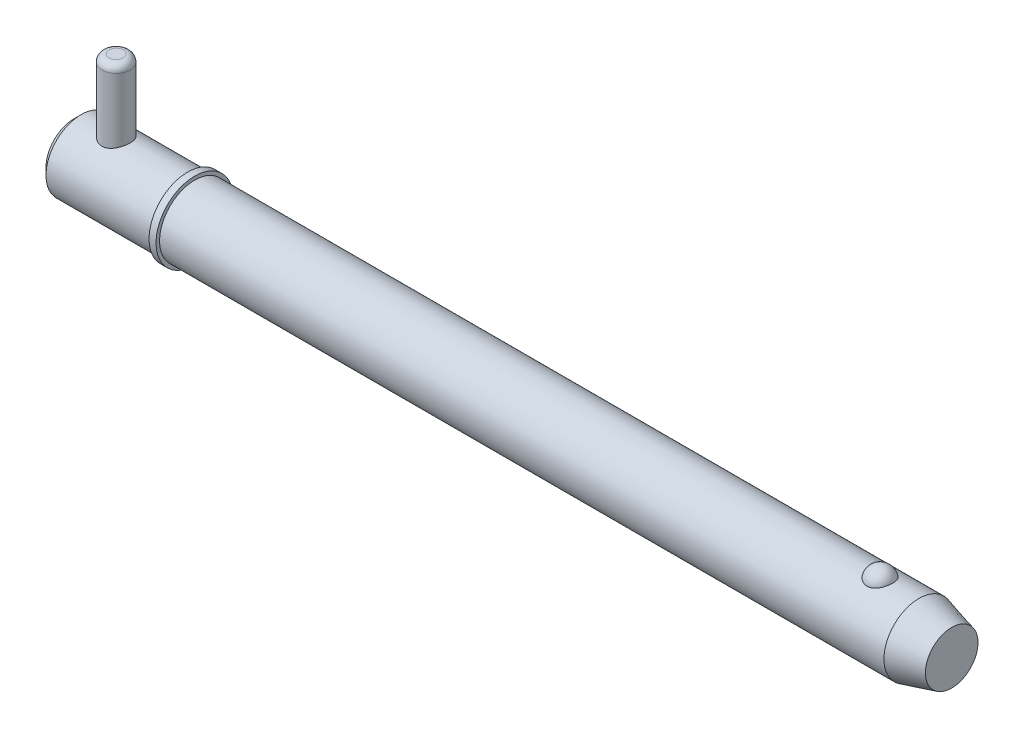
ISO-10303-21;
HEADER;
FILE_DESCRIPTION(('STEP AP214'),'2;1');
FILE_NAME('part.step','',(''),(''),'','','');
FILE_SCHEMA(('AUTOMOTIVE_DESIGN { 1 0 10303 214 1 1 1 1 }'));
ENDSEC;
DATA;
#1=APPLICATION_CONTEXT('core data for automotive mechanical design processes');
#2=APPLICATION_PROTOCOL_DEFINITION('international standard','automotive_design',2000,#1);
#3=PRODUCT_CONTEXT('',#1,'mechanical');
#4=PRODUCT('Part','Part','',(#3));
#5=PRODUCT_RELATED_PRODUCT_CATEGORY('part','',(#4));
#6=PRODUCT_DEFINITION_FORMATION('','',#4);
#7=PRODUCT_DEFINITION_CONTEXT('part definition',#1,'design');
#8=PRODUCT_DEFINITION('design','',#6,#7);
#9=PRODUCT_DEFINITION_SHAPE('','',#8);
#10=(LENGTH_UNIT() NAMED_UNIT(*) SI_UNIT(.MILLI.,.METRE.));
#11=(NAMED_UNIT(*) PLANE_ANGLE_UNIT() SI_UNIT($,.RADIAN.));
#12=(NAMED_UNIT(*) SI_UNIT($,.STERADIAN.) SOLID_ANGLE_UNIT());
#13=UNCERTAINTY_MEASURE_WITH_UNIT(LENGTH_MEASURE(1.E-05),#10,'distance_accuracy_value','');
#14=(GEOMETRIC_REPRESENTATION_CONTEXT(3) GLOBAL_UNCERTAINTY_ASSIGNED_CONTEXT((#13)) GLOBAL_UNIT_ASSIGNED_CONTEXT((#10,
#11,#12)) REPRESENTATION_CONTEXT('',''));
#15=CARTESIAN_POINT('',(0.,0.,0.));
#16=DIRECTION('',(0.,0.,1.));
#17=DIRECTION('',(1.,0.,0.));
#18=AXIS2_PLACEMENT_3D('',#15,#16,#17);
#19=CARTESIAN_POINT('',(9.525,23.81,0.));
#20=DIRECTION('',(0.,-1.,0.));
#21=DIRECTION('',(0.,0.,-1.));
#22=AXIS2_PLACEMENT_3D('',#19,#20,#21);
#23=CYLINDRICAL_SURFACE('',#22,3.175);
#24=CARTESIAN_POINT('',(9.525,-6.3525,0.));
#25=DIRECTION('',(0.,1.,0.));
#26=DIRECTION('',(0.,0.,1.));
#27=AXIS2_PLACEMENT_3D('',#24,#25,#26);
#28=CIRCLE('',#27,3.175);
#29=CARTESIAN_POINT('',(9.525,-6.3525,3.175));
#30=VERTEX_POINT('',#29);
#31=EDGE_CURVE('P0_E25',#30,#30,#28,.T.);
#32=ORIENTED_EDGE('',*,*,#31,.T.);
#33=EDGE_LOOP('',(#32));
#34=FACE_BOUND('',#33,.T.);
#35=CARTESIAN_POINT('',(9.525,22.2225,0.));
#36=DIRECTION('',(0.,1.,0.));
#37=DIRECTION('',(0.,0.,1.));
#38=AXIS2_PLACEMENT_3D('',#35,#36,#37);
#39=CIRCLE('',#38,3.175);
#40=CARTESIAN_POINT('',(9.525,22.2225,3.175));
#41=VERTEX_POINT('',#40);
#42=EDGE_CURVE('P0_E29',#41,#41,#39,.F.);
#43=ORIENTED_EDGE('',*,*,#42,.T.);
#44=EDGE_LOOP('',(#43));
#45=FACE_BOUND('',#44,.T.);
#46=ADVANCED_FACE('P0_F14',(#34,#45),#23,.T.);
#47=CARTESIAN_POINT('',(9.525,23.81,0.));
#48=DIRECTION('',(0.,1.,0.));
#49=DIRECTION('',(0.,0.,1.));
#50=AXIS2_PLACEMENT_3D('',#47,#48,#49);
#51=PLANE('',#50);
#52=CARTESIAN_POINT('',(9.525,23.81,0.));
#53=DIRECTION('',(0.,1.,0.));
#54=DIRECTION('',(0.,0.,1.));
#55=AXIS2_PLACEMENT_3D('',#52,#53,#54);
#56=CIRCLE('',#55,1.5875);
#57=CARTESIAN_POINT('',(9.525,23.81,1.5875));
#58=VERTEX_POINT('',#57);
#59=EDGE_CURVE('P0_E10',#58,#58,#56,.T.);
#60=ORIENTED_EDGE('',*,*,#59,.T.);
#61=EDGE_LOOP('',(#60));
#62=FACE_BOUND('',#61,.T.);
#63=ADVANCED_FACE('P0_F46',(#62),#51,.T.);
#64=CARTESIAN_POINT('',(9.525,-7.94,0.));
#65=DIRECTION('',(0.,1.,0.));
#66=DIRECTION('',(0.,0.,1.));
#67=AXIS2_PLACEMENT_3D('',#64,#65,#66);
#68=PLANE('',#67);
#69=CARTESIAN_POINT('',(9.525,-7.94,0.));
#70=DIRECTION('',(0.,1.,0.));
#71=DIRECTION('',(0.,0.,1.));
#72=AXIS2_PLACEMENT_3D('',#69,#70,#71);
#73=CIRCLE('',#72,1.5875);
#74=CARTESIAN_POINT('',(9.525,-7.94,1.5875));
#75=VERTEX_POINT('',#74);
#76=EDGE_CURVE('P0_E21',#75,#75,#73,.F.);
#77=ORIENTED_EDGE('',*,*,#76,.T.);
#78=EDGE_LOOP('',(#77));
#79=FACE_BOUND('',#78,.T.);
#80=ADVANCED_FACE('P0_F43',(#79),#68,.F.);
#81=CARTESIAN_POINT('',(9.525,-6.3525,0.));
#82=DIRECTION('',(0.,1.,0.));
#83=DIRECTION('',(0.,0.,1.));
#84=AXIS2_PLACEMENT_3D('',#81,#82,#83);
#85=DEGENERATE_TOROIDAL_SURFACE('',#84,1.5875,1.5875,.T.);
#86=ORIENTED_EDGE('',*,*,#76,.F.);
#87=EDGE_LOOP('',(#86));
#88=FACE_BOUND('',#87,.T.);
#89=ORIENTED_EDGE('',*,*,#31,.F.);
#90=EDGE_LOOP('',(#89));
#91=FACE_BOUND('',#90,.T.);
#92=ADVANCED_FACE('P0_F38',(#88,#91),#85,.T.);
#93=CARTESIAN_POINT('',(9.525,22.2225,0.));
#94=DIRECTION('',(0.,1.,0.));
#95=DIRECTION('',(0.,0.,1.));
#96=AXIS2_PLACEMENT_3D('',#93,#94,#95);
#97=DEGENERATE_TOROIDAL_SURFACE('',#96,1.5875,1.5875,.T.);
#98=ORIENTED_EDGE('',*,*,#42,.F.);
#99=EDGE_LOOP('',(#98));
#100=FACE_BOUND('',#99,.T.);
#101=ORIENTED_EDGE('',*,*,#59,.F.);
#102=EDGE_LOOP('',(#101));
#103=FACE_BOUND('',#102,.T.);
#104=ADVANCED_FACE('P0_F16',(#100,#103),#97,.T.);
#105=CLOSED_SHELL('',(#46,#63,#80,#92,#104));
#106=MANIFOLD_SOLID_BREP('P0_B1',#105);
#107=CARTESIAN_POINT('',(0.,0.,0.));
#108=DIRECTION('',(1.,0.,0.));
#109=DIRECTION('',(0.,0.,-1.));
#110=AXIS2_PLACEMENT_3D('',#107,#108,#109);
#111=CYLINDRICAL_SURFACE('',#110,7.94);
#112=CARTESIAN_POINT('',(191.351879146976,0.,0.));
#113=DIRECTION('',(1.,0.,0.));
#114=DIRECTION('',(0.,0.,-1.));
#115=AXIS2_PLACEMENT_3D('',#112,#113,#114);
#116=CIRCLE('',#115,7.94);
#117=CARTESIAN_POINT('',(191.351879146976,0.,-7.94));
#118=VERTEX_POINT('',#117);
#119=EDGE_CURVE('P1_E81',#118,#118,#116,.T.);
#120=ORIENTED_EDGE('',*,*,#119,.F.);
#121=EDGE_LOOP('',(#120));
#122=FACE_BOUND('',#121,.T.);
#123=CARTESIAN_POINT('',(27.31,0.,0.));
#124=DIRECTION('',(1.,0.,0.));
#125=DIRECTION('',(0.,0.,-1.));
#126=AXIS2_PLACEMENT_3D('',#123,#124,#125);
#127=CIRCLE('',#126,7.94);
#128=CARTESIAN_POINT('',(27.31,0.,-7.94));
#129=VERTEX_POINT('',#128);
#130=EDGE_CURVE('P1_E85',#129,#129,#127,.T.);
#131=ORIENTED_EDGE('',*,*,#130,.T.);
#132=EDGE_LOOP('',(#131));
#133=FACE_BOUND('',#132,.T.);
#134=CARTESIAN_POINT('',(182.544907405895,7.37767842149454,2.93486986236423));
#135=CARTESIAN_POINT('',(182.392749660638,7.3776732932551,2.93487505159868));
#136=CARTESIAN_POINT('',(182.240632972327,7.38258419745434,2.92262454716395));
#137=CARTESIAN_POINT('',(181.940928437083,7.40163229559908,2.87404196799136));
#138=CARTESIAN_POINT('',(181.793339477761,7.41576720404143,2.83771585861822));
#139=CARTESIAN_POINT('',(181.507018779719,7.45161576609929,2.74218769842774));
#140=CARTESIAN_POINT('',(181.368274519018,7.47331841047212,2.68301886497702));
#141=CARTESIAN_POINT('',(181.102882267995,7.52194082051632,2.54350967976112));
#142=CARTESIAN_POINT('',(180.976236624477,7.54886159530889,2.46316523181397));
#143=CARTESIAN_POINT('',(180.734534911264,7.60594671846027,2.28090375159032));
#144=CARTESIAN_POINT('',(180.619906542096,7.63618114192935,2.1784421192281));
#145=CARTESIAN_POINT('',(180.408878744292,7.69614046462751,1.95608495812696));
#146=CARTESIAN_POINT('',(180.312482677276,7.72586526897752,1.83618622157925));
#147=CARTESIAN_POINT('',(180.135938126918,7.78314821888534,1.57628086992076));
#148=CARTESIAN_POINT('',(180.056707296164,7.81055035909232,1.43561546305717));
#149=CARTESIAN_POINT('',(179.921797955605,7.85879631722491,1.14236334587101));
#150=CARTESIAN_POINT('',(179.866121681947,7.87963951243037,0.989775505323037));
#151=CARTESIAN_POINT('',(179.77881215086,7.91289645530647,0.674619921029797));
#152=CARTESIAN_POINT('',(179.74753090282,7.92518652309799,0.511941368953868));
#153=CARTESIAN_POINT('',(179.710975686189,7.93958930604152,0.183247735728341));
#154=CARTESIAN_POINT('',(179.705701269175,7.94170219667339,0.0172327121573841));
#155=CARTESIAN_POINT('',(179.721231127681,7.93554931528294,-0.312672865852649));
#156=CARTESIAN_POINT('',(179.741925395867,7.92732732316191,-0.476569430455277));
#157=CARTESIAN_POINT('',(179.80878655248,7.90141534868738,-0.79830524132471));
#158=CARTESIAN_POINT('',(179.854953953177,7.88372517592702,-0.956144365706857));
#159=CARTESIAN_POINT('',(179.971898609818,7.84066230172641,-1.26152073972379));
#160=CARTESIAN_POINT('',(180.042704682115,7.81528060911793,-1.40904568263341));
#161=CARTESIAN_POINT('',(180.207478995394,7.75948672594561,-1.68950598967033));
#162=CARTESIAN_POINT('',(180.301448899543,7.72907417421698,-1.82244030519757));
#163=CARTESIAN_POINT('',(180.510839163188,7.66640424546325,-2.07032792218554));
#164=CARTESIAN_POINT('',(180.626315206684,7.63414223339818,-2.18523308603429));
#165=CARTESIAN_POINT('',(180.8759006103,7.57149681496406,-2.39329737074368));
#166=CARTESIAN_POINT('',(181.010008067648,7.54111321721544,-2.48645870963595));
#167=CARTESIAN_POINT('',(181.290111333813,7.48650742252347,-2.64628132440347));
#168=CARTESIAN_POINT('',(181.435760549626,7.46215900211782,-2.71350554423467));
#169=CARTESIAN_POINT('',(181.737425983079,7.42171253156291,-2.82226614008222));
#170=CARTESIAN_POINT('',(181.893438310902,7.40561140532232,-2.86381209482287));
#171=CARTESIAN_POINT('',(182.202970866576,7.3842679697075,-2.9183907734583));
#172=CARTESIAN_POINT('',(182.356222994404,7.37852109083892,-2.93275024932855));
#173=CARTESIAN_POINT('',(182.663070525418,7.37700973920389,-2.93655208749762));
#174=CARTESIAN_POINT('',(182.816665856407,7.38124333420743,-2.92599927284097));
#175=CARTESIAN_POINT('',(183.114990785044,7.39890635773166,-2.88102897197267));
#176=CARTESIAN_POINT('',(183.259848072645,7.41205491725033,-2.84733999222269));
#177=CARTESIAN_POINT('',(183.54164329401,7.445801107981,-2.75788206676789));
#178=CARTESIAN_POINT('',(183.678580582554,7.46639934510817,-2.70211132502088));
#179=CARTESIAN_POINT('',(183.944061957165,7.51339098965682,-2.56858908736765));
#180=CARTESIAN_POINT('',(184.072354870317,7.53990200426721,-2.4903806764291));
#181=CARTESIAN_POINT('',(184.314244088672,7.59569503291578,-2.31462737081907));
#182=CARTESIAN_POINT('',(184.427837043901,7.6249776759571,-2.21707808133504));
#183=CARTESIAN_POINT('',(184.64322156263,7.68489473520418,-1.99982049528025));
#184=CARTESIAN_POINT('',(184.744148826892,7.71552419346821,-1.87925337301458));
#185=CARTESIAN_POINT('',(184.925186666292,7.77353016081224,-1.6226882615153));
#186=CARTESIAN_POINT('',(185.005293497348,7.80090608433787,-1.48668750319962));
#187=CARTESIAN_POINT('',(185.145361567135,7.85047992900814,-1.1981841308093));
#188=CARTESIAN_POINT('',(185.204587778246,7.87248183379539,-1.04529016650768));
#189=CARTESIAN_POINT('',(185.297982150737,7.90785114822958,-0.731080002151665));
#190=CARTESIAN_POINT('',(185.332149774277,7.92121837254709,-0.569763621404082));
#191=CARTESIAN_POINT('',(185.374795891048,7.93797834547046,-0.242812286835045));
#192=CARTESIAN_POINT('',(185.383204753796,7.94134405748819,-0.0771668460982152));
#193=CARTESIAN_POINT('',(185.373962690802,7.93767937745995,0.253276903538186));
#194=CARTESIAN_POINT('',(185.356312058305,7.93064910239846,0.418075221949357));
#195=CARTESIAN_POINT('',(185.295424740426,7.90695571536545,0.741525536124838));
#196=CARTESIAN_POINT('',(185.252281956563,7.8903279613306,0.900197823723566));
#197=CARTESIAN_POINT('',(185.14135358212,7.84916386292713,1.20759654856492));
#198=CARTESIAN_POINT('',(185.07356656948,7.82462706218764,1.35632241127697));
#199=CARTESIAN_POINT('',(184.914371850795,7.77006699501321,1.64032869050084));
#200=CARTESIAN_POINT('',(184.822861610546,7.74002008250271,1.7755471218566));
#201=CARTESIAN_POINT('',(184.618296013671,7.67774175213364,2.0280064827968));
#202=CARTESIAN_POINT('',(184.505241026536,7.64551037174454,2.14524772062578));
#203=CARTESIAN_POINT('',(184.260831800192,7.58265895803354,2.35778002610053));
#204=CARTESIAN_POINT('',(184.129583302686,7.5520309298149,2.45319004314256));
#205=CARTESIAN_POINT('',(183.851601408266,7.49579792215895,2.61999897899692));
#206=CARTESIAN_POINT('',(183.704867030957,7.4701932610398,2.69139637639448));
#207=CARTESIAN_POINT('',(183.392947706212,7.42622216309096,2.8105324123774));
#208=CARTESIAN_POINT('',(183.227220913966,7.40825002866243,2.85700910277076));
#209=CARTESIAN_POINT('',(182.889279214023,7.38398348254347,2.9191685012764));
#210=CARTESIAN_POINT('',(182.71706702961,7.3776842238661,2.93486399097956));
#211=CARTESIAN_POINT('',(182.544907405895,7.37767842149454,2.93486986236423));
#212=B_SPLINE_CURVE_WITH_KNOTS('',3,(#134,#135,#136,#137,#138,#139,#140,#141,#142,#143,#144,
#145,#146,#147,#148,#149,#150,#151,#152,#153,#154,#155,#156,#157,#158,#159,#160,#161,#162,#163,
#164,#165,#166,#167,#168,#169,#170,#171,#172,#173,#174,#175,#176,#177,#178,#179,#180,#181,#182,
#183,#184,#185,#186,#187,#188,#189,#190,#191,#192,#193,#194,#195,#196,#197,#198,#199,#200,#201,
#202,#203,#204,#205,#206,#207,#208,#209,#210,#211),.UNSPECIFIED.,.T.,.F.,(4,2,2,2,2,2,2,2,2,2,2,
2,2,2,2,2,2,2,2,2,2,2,2,2,2,2,2,2,2,2,2,2,2,2,2,2,2,2,4),(0.,0.455841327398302,
0.911569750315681,1.36663794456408,1.82179423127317,2.2897898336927,2.75787163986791,
3.24685368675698,3.73588214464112,4.23184282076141,4.72779494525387,5.22165321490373,
5.71552141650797,6.2099691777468,6.7044524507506,7.20023431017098,7.69596557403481,
8.18023418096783,8.66432203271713,9.1241069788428,9.58380291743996,10.0296503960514,
10.4755341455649,10.9312349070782,11.3870393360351,11.8654416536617,12.3439299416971,
12.8378875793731,13.3318558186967,13.8271581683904,14.3224549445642,14.8159385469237,
15.3094506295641,15.8051323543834,16.3008055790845,16.7937101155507,17.2866458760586,
17.8026240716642,18.3183879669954),.UNSPECIFIED.);
#213=CARTESIAN_POINT('',(182.544907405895,7.37767842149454,2.93486986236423));
#214=VERTEX_POINT('',#213);
#215=EDGE_CURVE('P1_E35',#214,#214,#212,.T.);
#216=ORIENTED_EDGE('',*,*,#215,.T.);
#217=EDGE_LOOP('',(#216));
#218=FACE_BOUND('',#217,.T.);
#219=ADVANCED_FACE('P1_F13',(#122,#133,#218),#111,.T.);
#220=CARTESIAN_POINT('',(0.,0.,0.));
#221=DIRECTION('',(-1.,0.,0.));
#222=DIRECTION('',(0.,0.,1.));
#223=AXIS2_PLACEMENT_3D('',#220,#221,#222);
#224=PLANE('',#223);
#225=CARTESIAN_POINT('',(0.,0.,0.));
#226=DIRECTION('',(1.,0.,0.));
#227=DIRECTION('',(0.,0.,-1.));
#228=AXIS2_PLACEMENT_3D('',#225,#226,#227);
#229=CIRCLE('',#228,6.352);
#230=CARTESIAN_POINT('',(0.,0.,-6.352));
#231=VERTEX_POINT('',#230);
#232=EDGE_CURVE('P1_E9',#231,#231,#229,.T.);
#233=ORIENTED_EDGE('',*,*,#232,.F.);
#234=EDGE_LOOP('',(#233));
#235=FACE_BOUND('',#234,.T.);
#236=ADVANCED_FACE('P1_F15',(#235),#224,.T.);
#237=CARTESIAN_POINT('',(1.58799999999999,0.,0.));
#238=DIRECTION('',(1.,0.,0.));
#239=DIRECTION('',(0.,0.,-1.));
#240=AXIS2_PLACEMENT_3D('',#237,#238,#239);
#241=CONICAL_SURFACE('',#240,7.94,0.78539816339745);
#242=ORIENTED_EDGE('',*,*,#232,.T.);
#243=EDGE_LOOP('',(#242));
#244=FACE_BOUND('',#243,.T.);
#245=CARTESIAN_POINT('',(1.58799999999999,0.,0.));
#246=DIRECTION('',(1.,0.,0.));
#247=DIRECTION('',(0.,0.,-1.));
#248=AXIS2_PLACEMENT_3D('',#245,#246,#247);
#249=CIRCLE('',#248,7.94);
#250=CARTESIAN_POINT('',(1.58799999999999,0.,-7.94));
#251=VERTEX_POINT('',#250);
#252=EDGE_CURVE('P1_E26',#251,#251,#249,.T.);
#253=ORIENTED_EDGE('',*,*,#252,.F.);
#254=EDGE_LOOP('',(#253));
#255=FACE_BOUND('',#254,.T.);
#256=ADVANCED_FACE('P1_F77',(#244,#255),#241,.T.);
#257=CARTESIAN_POINT('',(0.,0.,0.));
#258=DIRECTION('',(1.,0.,0.));
#259=DIRECTION('',(0.,0.,-1.));
#260=AXIS2_PLACEMENT_3D('',#257,#258,#259);
#261=CYLINDRICAL_SURFACE('',#260,7.94);
#262=CARTESIAN_POINT('',(9.525,-7.27756655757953,3.175));
#263=CARTESIAN_POINT('',(9.43992346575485,-7.27756715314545,3.17499935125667));
#264=CARTESIAN_POINT('',(9.35481882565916,-7.27906496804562,3.1715736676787));
#265=CARTESIAN_POINT('',(9.18524505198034,-7.28499816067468,3.15791803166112));
#266=CARTESIAN_POINT('',(9.100776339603,-7.28943533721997,3.14768391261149));
#267=CARTESIAN_POINT('',(8.84895715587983,-7.30698881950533,3.10684226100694));
#268=CARTESIAN_POINT('',(8.6834173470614,-7.32434654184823,3.06609574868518));
#269=CARTESIAN_POINT('',(8.36278910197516,-7.36806950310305,2.95945910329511));
#270=CARTESIAN_POINT('',(8.20766386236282,-7.39440078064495,2.89366366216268));
#271=CARTESIAN_POINT('',(7.91065319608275,-7.45304562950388,2.73907413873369));
#272=CARTESIAN_POINT('',(7.76876488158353,-7.48535789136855,2.65028508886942));
#273=CARTESIAN_POINT('',(7.49411086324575,-7.55439482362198,2.44679888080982));
#274=CARTESIAN_POINT('',(7.36219910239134,-7.59126138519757,2.33099745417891));
#275=CARTESIAN_POINT('',(7.11904234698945,-7.66408045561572,2.07909838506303));
#276=CARTESIAN_POINT('',(7.00780457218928,-7.70003264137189,1.94299368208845));
#277=CARTESIAN_POINT('',(6.80492173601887,-7.76867514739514,1.64775981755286));
#278=CARTESIAN_POINT('',(6.71422139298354,-7.80118112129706,1.48793473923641));
#279=CARTESIAN_POINT('',(6.56135788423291,-7.85754918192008,1.15376269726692));
#280=CARTESIAN_POINT('',(6.49918311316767,-7.88141478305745,0.979421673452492));
#281=CARTESIAN_POINT('',(6.40818142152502,-7.91680873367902,0.630115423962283));
#282=CARTESIAN_POINT('',(6.3778864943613,-7.9288781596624,0.455588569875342));
#283=CARTESIAN_POINT('',(6.34677743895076,-7.94127547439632,0.103539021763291));
#284=CARTESIAN_POINT('',(6.34595232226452,-7.94160773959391,-0.0739825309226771));
#285=CARTESIAN_POINT('',(6.37300128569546,-7.93082261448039,-0.416371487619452));
#286=CARTESIAN_POINT('',(6.39926693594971,-7.92034690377,-0.581389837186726));
#287=CARTESIAN_POINT('',(6.47701615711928,-7.88998770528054,-0.904449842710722));
#288=CARTESIAN_POINT('',(6.52850157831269,-7.87010352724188,-1.06249098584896));
#289=CARTESIAN_POINT('',(6.65586120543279,-7.82249343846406,-1.36995769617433));
#290=CARTESIAN_POINT('',(6.73209124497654,-7.79465387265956,-1.51921754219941));
#291=CARTESIAN_POINT('',(6.90644286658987,-7.73389606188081,-1.80321183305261));
#292=CARTESIAN_POINT('',(7.00457194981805,-7.70097607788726,-1.93794127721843));
#293=CARTESIAN_POINT('',(7.22744086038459,-7.63084889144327,-2.19843606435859));
#294=CARTESIAN_POINT('',(7.35350432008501,-7.59350211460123,-2.3230330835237));
#295=CARTESIAN_POINT('',(7.62488266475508,-7.52039654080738,-2.54979642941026));
#296=CARTESIAN_POINT('',(7.77020381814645,-7.48463826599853,-2.65195542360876));
#297=CARTESIAN_POINT('',(8.08119298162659,-7.41780943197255,-2.83361305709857));
#298=CARTESIAN_POINT('',(8.24731937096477,-7.38689959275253,-2.91239105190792));
#299=CARTESIAN_POINT('',(8.59204539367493,-7.33515216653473,-3.04038913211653));
#300=CARTESIAN_POINT('',(8.77063684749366,-7.31430804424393,-3.08962840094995));
#301=CARTESIAN_POINT('',(9.12356982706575,-7.28663831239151,-3.15431018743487));
#302=CARTESIAN_POINT('',(9.29750494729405,-7.2790344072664,-3.17163284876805));
#303=CARTESIAN_POINT('',(9.64592502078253,-7.27648884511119,-3.17747282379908));
#304=CARTESIAN_POINT('',(9.82040979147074,-7.28154335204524,-3.16599886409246));
#305=CARTESIAN_POINT('',(10.1545374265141,-7.30294638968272,-3.11628310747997));
#306=CARTESIAN_POINT('',(10.3144598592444,-7.31863587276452,-3.0796016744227));
#307=CARTESIAN_POINT('',(10.625774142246,-7.35872371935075,-2.98253618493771));
#308=CARTESIAN_POINT('',(10.7771640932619,-7.38312401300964,-2.92214687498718));
#309=CARTESIAN_POINT('',(11.0739599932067,-7.4390944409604,-2.77664664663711));
#310=CARTESIAN_POINT('',(11.2188745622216,-7.47091513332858,-2.69063278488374));
#311=CARTESIAN_POINT('',(11.4928722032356,-7.53775867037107,-2.49724834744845));
#312=CARTESIAN_POINT('',(11.6219487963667,-7.57278281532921,-2.38986907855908));
#313=CARTESIAN_POINT('',(11.8705091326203,-7.64520845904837,-2.1474449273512));
#314=CARTESIAN_POINT('',(11.9885816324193,-7.68259462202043,-2.01094304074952));
#315=CARTESIAN_POINT('',(12.2003631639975,-7.75309951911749,-1.71917041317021));
#316=CARTESIAN_POINT('',(12.2940712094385,-7.78621808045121,-1.56389891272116));
#317=CARTESIAN_POINT('',(12.4541161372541,-7.84456050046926,-1.23845027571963));
#318=CARTESIAN_POINT('',(12.5204600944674,-7.86978639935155,-1.06827700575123));
#319=CARTESIAN_POINT('',(12.6231407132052,-7.90943635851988,-0.717928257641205));
#320=CARTESIAN_POINT('',(12.6594936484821,-7.92386627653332,-0.537758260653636));
#321=CARTESIAN_POINT('',(12.6992281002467,-7.93967263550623,-0.185201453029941));
#322=CARTESIAN_POINT('',(12.7046050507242,-7.94183891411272,-0.0130732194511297));
#323=CARTESIAN_POINT('',(12.6875036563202,-7.9350072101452,0.329549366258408));
#324=CARTESIAN_POINT('',(12.6650295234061,-7.92601091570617,0.500043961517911));
#325=CARTESIAN_POINT('',(12.5942896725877,-7.89825976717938,0.829196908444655));
#326=CARTESIAN_POINT('',(12.5468364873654,-7.87981280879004,0.988057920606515));
#327=CARTESIAN_POINT('',(12.4283390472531,-7.83513565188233,1.29553461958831));
#328=CARTESIAN_POINT('',(12.3572904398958,-7.8089040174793,1.44414841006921));
#329=CARTESIAN_POINT('',(12.1900822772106,-7.7497911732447,1.73412879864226));
#330=CARTESIAN_POINT('',(12.0929519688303,-7.71666737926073,1.87488510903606));
#331=CARTESIAN_POINT('',(11.8777894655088,-7.64775894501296,2.13869231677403));
#332=CARTESIAN_POINT('',(11.7597486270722,-7.61197320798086,2.26173585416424));
#333=CARTESIAN_POINT('',(11.4974896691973,-7.53902341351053,2.49449755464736));
#334=CARTESIAN_POINT('',(11.3521039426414,-7.50191102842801,2.60292060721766));
#335=CARTESIAN_POINT('',(11.0440201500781,-7.43289551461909,2.79392602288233));
#336=CARTESIAN_POINT('',(10.8813200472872,-7.40099299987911,2.87650534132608));
#337=CARTESIAN_POINT('',(10.558064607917,-7.3489506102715,3.00682739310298));
#338=CARTESIAN_POINT('',(10.398627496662,-7.32801197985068,3.05703164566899));
#339=CARTESIAN_POINT('',(10.0731242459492,-7.29639491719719,3.13175843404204));
#340=CARTESIAN_POINT('',(9.90707793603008,-7.28568789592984,3.15635254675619));
#341=CARTESIAN_POINT('',(9.70441566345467,-7.27968826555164,3.17013149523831));
#342=CARTESIAN_POINT('',(9.66856669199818,-7.27889378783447,3.17195593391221));
#343=CARTESIAN_POINT('',(9.59681348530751,-7.27783278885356,3.17439036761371));
#344=CARTESIAN_POINT('',(9.56090924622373,-7.27756630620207,3.17500027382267));
#345=CARTESIAN_POINT('',(9.525,-7.27756655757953,3.175));
#346=B_SPLINE_CURVE_WITH_KNOTS('',3,(#262,#263,#264,#265,#266,#267,#268,#269,#270,#271,#272,
#273,#274,#275,#276,#277,#278,#279,#280,#281,#282,#283,#284,#285,#286,#287,#288,#289,#290,#291,
#292,#293,#294,#295,#296,#297,#298,#299,#300,#301,#302,#303,#304,#305,#306,#307,#308,#309,#310,
#311,#312,#313,#314,#315,#316,#317,#318,#319,#320,#321,#322,#323,#324,#325,#326,#327,#328,#329,
#330,#331,#332,#333,#334,#335,#336,#337,#338,#339,#340,#341,#342,#343,#344,#345),.UNSPECIFIED.,
.T.,.F.,(4,2,2,2,2,2,2,2,2,2,2,2,2,2,2,2,2,2,2,2,2,2,2,2,2,2,2,2,2,2,2,2,2,2,2,2,2,2,2,2,2,4),
(0.,0.255187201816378,0.510530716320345,1.0218798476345,1.53131482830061,2.04063840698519,
2.57635929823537,3.11226692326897,3.66929090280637,4.22608806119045,4.75594400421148,
5.28560237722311,5.78552836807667,6.28549104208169,6.79298787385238,7.30065880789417,
7.8416422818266,8.38280228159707,8.93923025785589,9.49529647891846,10.0174074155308,
10.5393601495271,11.0316114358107,11.5239718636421,12.0362920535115,12.5488211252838,
13.0991799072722,13.6495609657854,14.1997996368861,14.7497395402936,15.2638187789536,
15.7778202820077,16.2760504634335,16.7743726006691,17.294711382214,17.8152657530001,
18.3680208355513,18.9208410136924,19.4240423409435,19.9258334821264,20.0335354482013,
20.1412452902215),.UNSPECIFIED.);
#347=CARTESIAN_POINT('',(9.525,-7.27756655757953,3.175));
#348=VERTEX_POINT('',#347);
#349=EDGE_CURVE('P1_E17',#348,#348,#346,.T.);
#350=ORIENTED_EDGE('',*,*,#349,.F.);
#351=EDGE_LOOP('',(#350));
#352=FACE_BOUND('',#351,.T.);
#353=CARTESIAN_POINT('',(9.525,7.27756655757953,3.175));
#354=CARTESIAN_POINT('',(9.61007653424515,7.27756715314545,3.17499935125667));
#355=CARTESIAN_POINT('',(9.69518117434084,7.27906496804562,3.1715736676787));
#356=CARTESIAN_POINT('',(9.86475494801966,7.28499816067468,3.15791803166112));
#357=CARTESIAN_POINT('',(9.949223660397,7.28943533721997,3.14768391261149));
#358=CARTESIAN_POINT('',(10.2010428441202,7.30698881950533,3.10684226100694));
#359=CARTESIAN_POINT('',(10.3665826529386,7.32434654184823,3.06609574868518));
#360=CARTESIAN_POINT('',(10.6872108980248,7.36806950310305,2.95945910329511));
#361=CARTESIAN_POINT('',(10.8423361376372,7.39440078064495,2.89366366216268));
#362=CARTESIAN_POINT('',(11.1393468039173,7.45304562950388,2.73907413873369));
#363=CARTESIAN_POINT('',(11.2812351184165,7.48535789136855,2.65028508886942));
#364=CARTESIAN_POINT('',(11.5558891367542,7.55439482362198,2.44679888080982));
#365=CARTESIAN_POINT('',(11.6878008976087,7.59126138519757,2.33099745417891));
#366=CARTESIAN_POINT('',(11.9309576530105,7.66408045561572,2.07909838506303));
#367=CARTESIAN_POINT('',(12.0421954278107,7.70003264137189,1.94299368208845));
#368=CARTESIAN_POINT('',(12.2450782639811,7.76867514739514,1.64775981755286));
#369=CARTESIAN_POINT('',(12.3357786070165,7.80118112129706,1.48793473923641));
#370=CARTESIAN_POINT('',(12.4886421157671,7.85754918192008,1.15376269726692));
#371=CARTESIAN_POINT('',(12.5508168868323,7.88141478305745,0.979421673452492));
#372=CARTESIAN_POINT('',(12.641818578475,7.91680873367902,0.630115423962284));
#373=CARTESIAN_POINT('',(12.6721135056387,7.9288781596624,0.455588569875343));
#374=CARTESIAN_POINT('',(12.7032225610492,7.94127547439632,0.103539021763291));
#375=CARTESIAN_POINT('',(12.7040476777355,7.94160773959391,-0.0739825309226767));
#376=CARTESIAN_POINT('',(12.6769987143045,7.93082261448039,-0.416371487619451));
#377=CARTESIAN_POINT('',(12.6507330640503,7.92034690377,-0.581389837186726));
#378=CARTESIAN_POINT('',(12.5729838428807,7.88998770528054,-0.904449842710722));
#379=CARTESIAN_POINT('',(12.5214984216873,7.87010352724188,-1.06249098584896));
#380=CARTESIAN_POINT('',(12.3941387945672,7.82249343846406,-1.36995769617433));
#381=CARTESIAN_POINT('',(12.3179087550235,7.79465387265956,-1.51921754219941));
#382=CARTESIAN_POINT('',(12.1435571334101,7.73389606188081,-1.80321183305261));
#383=CARTESIAN_POINT('',(12.0454280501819,7.70097607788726,-1.93794127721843));
#384=CARTESIAN_POINT('',(11.8225591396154,7.63084889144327,-2.19843606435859));
#385=CARTESIAN_POINT('',(11.696495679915,7.59350211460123,-2.3230330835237));
#386=CARTESIAN_POINT('',(11.4251173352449,7.52039654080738,-2.54979642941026));
#387=CARTESIAN_POINT('',(11.2797961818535,7.48463826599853,-2.65195542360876));
#388=CARTESIAN_POINT('',(10.9688070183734,7.41780943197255,-2.83361305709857));
#389=CARTESIAN_POINT('',(10.8026806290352,7.38689959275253,-2.91239105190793));
#390=CARTESIAN_POINT('',(10.4579546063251,7.33515216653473,-3.04038913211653));
#391=CARTESIAN_POINT('',(10.2793631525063,7.31430804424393,-3.08962840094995));
#392=CARTESIAN_POINT('',(9.92643017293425,7.28663831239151,-3.15431018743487));
#393=CARTESIAN_POINT('',(9.75249505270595,7.2790344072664,-3.17163284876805));
#394=CARTESIAN_POINT('',(9.40407497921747,7.2764888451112,-3.17747282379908));
#395=CARTESIAN_POINT('',(9.22959020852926,7.28154335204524,-3.16599886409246));
#396=CARTESIAN_POINT('',(8.89546257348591,7.30294638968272,-3.11628310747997));
#397=CARTESIAN_POINT('',(8.73554014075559,7.31863587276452,-3.0796016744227));
#398=CARTESIAN_POINT('',(8.42422585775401,7.35872371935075,-2.98253618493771));
#399=CARTESIAN_POINT('',(8.27283590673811,7.38312401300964,-2.92214687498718));
#400=CARTESIAN_POINT('',(7.97604000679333,7.4390944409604,-2.77664664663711));
#401=CARTESIAN_POINT('',(7.83112543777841,7.47091513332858,-2.69063278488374));
#402=CARTESIAN_POINT('',(7.55712779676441,7.53775867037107,-2.49724834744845));
#403=CARTESIAN_POINT('',(7.42805120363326,7.57278281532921,-2.38986907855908));
#404=CARTESIAN_POINT('',(7.17949086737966,7.64520845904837,-2.1474449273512));
#405=CARTESIAN_POINT('',(7.06141836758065,7.68259462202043,-2.01094304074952));
#406=CARTESIAN_POINT('',(6.8496368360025,7.75309951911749,-1.71917041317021));
#407=CARTESIAN_POINT('',(6.75592879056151,7.78621808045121,-1.56389891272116));
#408=CARTESIAN_POINT('',(6.59588386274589,7.84456050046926,-1.23845027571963));
#409=CARTESIAN_POINT('',(6.52953990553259,7.86978639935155,-1.06827700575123));
#410=CARTESIAN_POINT('',(6.42685928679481,7.90943635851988,-0.717928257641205));
#411=CARTESIAN_POINT('',(6.39050635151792,7.92386627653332,-0.537758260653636));
#412=CARTESIAN_POINT('',(6.35077189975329,7.93967263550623,-0.18520145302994));
#413=CARTESIAN_POINT('',(6.34539494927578,7.94183891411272,-0.0130732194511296));
#414=CARTESIAN_POINT('',(6.36249634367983,7.9350072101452,0.329549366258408));
#415=CARTESIAN_POINT('',(6.38497047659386,7.92601091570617,0.500043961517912));
#416=CARTESIAN_POINT('',(6.45571032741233,7.89825976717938,0.829196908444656));
#417=CARTESIAN_POINT('',(6.50316351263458,7.87981280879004,0.988057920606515));
#418=CARTESIAN_POINT('',(6.62166095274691,7.83513565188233,1.29553461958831));
#419=CARTESIAN_POINT('',(6.69270956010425,7.8089040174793,1.44414841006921));
#420=CARTESIAN_POINT('',(6.85991772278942,7.7497911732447,1.73412879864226));
#421=CARTESIAN_POINT('',(6.95704803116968,7.71666737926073,1.87488510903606));
#422=CARTESIAN_POINT('',(7.17221053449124,7.64775894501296,2.13869231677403));
#423=CARTESIAN_POINT('',(7.29025137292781,7.61197320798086,2.26173585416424));
#424=CARTESIAN_POINT('',(7.55251033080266,7.53902341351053,2.49449755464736));
#425=CARTESIAN_POINT('',(7.69789605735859,7.50191102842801,2.60292060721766));
#426=CARTESIAN_POINT('',(8.00597984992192,7.43289551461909,2.79392602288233));
#427=CARTESIAN_POINT('',(8.16867995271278,7.40099299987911,2.87650534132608));
#428=CARTESIAN_POINT('',(8.49193539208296,7.3489506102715,3.00682739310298));
#429=CARTESIAN_POINT('',(8.65137250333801,7.32801197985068,3.05703164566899));
#430=CARTESIAN_POINT('',(8.97687575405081,7.29639491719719,3.13175843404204));
#431=CARTESIAN_POINT('',(9.14292206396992,7.28568789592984,3.15635254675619));
#432=CARTESIAN_POINT('',(9.34558433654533,7.27968826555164,3.17013149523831));
#433=CARTESIAN_POINT('',(9.38143330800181,7.27889378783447,3.17195593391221));
#434=CARTESIAN_POINT('',(9.45318651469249,7.27783278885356,3.17439036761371));
#435=CARTESIAN_POINT('',(9.48909075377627,7.27756630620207,3.17500027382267));
#436=CARTESIAN_POINT('',(9.525,7.27756655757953,3.175));
#437=B_SPLINE_CURVE_WITH_KNOTS('',3,(#353,#354,#355,#356,#357,#358,#359,#360,#361,#362,#363,
#364,#365,#366,#367,#368,#369,#370,#371,#372,#373,#374,#375,#376,#377,#378,#379,#380,#381,#382,
#383,#384,#385,#386,#387,#388,#389,#390,#391,#392,#393,#394,#395,#396,#397,#398,#399,#400,#401,
#402,#403,#404,#405,#406,#407,#408,#409,#410,#411,#412,#413,#414,#415,#416,#417,#418,#419,#420,
#421,#422,#423,#424,#425,#426,#427,#428,#429,#430,#431,#432,#433,#434,#435,#436),.UNSPECIFIED.,
.T.,.F.,(4,2,2,2,2,2,2,2,2,2,2,2,2,2,2,2,2,2,2,2,2,2,2,2,2,2,2,2,2,2,2,2,2,2,2,2,2,2,2,2,2,4),
(0.,0.255187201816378,0.510530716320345,1.0218798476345,1.53131482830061,2.04063840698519,
2.57635929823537,3.11226692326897,3.66929090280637,4.22608806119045,4.75594400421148,
5.2856023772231,5.78552836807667,6.28549104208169,6.79298787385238,7.30065880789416,
7.8416422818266,8.38280228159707,8.9392302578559,9.49529647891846,10.0174074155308,
10.5393601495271,11.0316114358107,11.5239718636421,12.0362920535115,12.5488211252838,
13.0991799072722,13.6495609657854,14.1997996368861,14.7497395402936,15.2638187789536,
15.7778202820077,16.2760504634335,16.7743726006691,17.294711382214,17.8152657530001,
18.3680208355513,18.9208410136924,19.4240423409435,19.9258334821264,20.0335354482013,
20.1412452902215),.UNSPECIFIED.);
#438=CARTESIAN_POINT('',(9.525,7.27756655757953,3.175));
#439=VERTEX_POINT('',#438);
#440=EDGE_CURVE('P1_E43',#439,#439,#437,.T.);
#441=ORIENTED_EDGE('',*,*,#440,.F.);
#442=EDGE_LOOP('',(#441));
#443=FACE_BOUND('',#442,.T.);
#444=ORIENTED_EDGE('',*,*,#252,.T.);
#445=EDGE_LOOP('',(#444));
#446=FACE_BOUND('',#445,.T.);
#447=CARTESIAN_POINT('',(25.722,0.,0.));
#448=DIRECTION('',(1.,0.,0.));
#449=DIRECTION('',(0.,0.,-1.));
#450=AXIS2_PLACEMENT_3D('',#447,#448,#449);
#451=CIRCLE('',#450,7.94);
#452=CARTESIAN_POINT('',(25.722,0.,-7.94));
#453=VERTEX_POINT('',#452);
#454=EDGE_CURVE('P1_E31',#453,#453,#451,.T.);
#455=ORIENTED_EDGE('',*,*,#454,.F.);
#456=EDGE_LOOP('',(#455));
#457=FACE_BOUND('',#456,.T.);
#458=ADVANCED_FACE('P1_F103',(#352,#443,#446,#457),#261,.T.);
#459=CARTESIAN_POINT('',(25.722,7.94,0.));
#460=DIRECTION('',(-1.,0.,0.));
#461=DIRECTION('',(0.,0.,1.));
#462=AXIS2_PLACEMENT_3D('',#459,#460,#461);
#463=PLANE('',#462);
#464=ORIENTED_EDGE('',*,*,#454,.T.);
#465=EDGE_LOOP('',(#464));
#466=FACE_BOUND('',#465,.T.);
#467=CARTESIAN_POINT('',(25.722,0.,0.));
#468=DIRECTION('',(1.,0.,0.));
#469=DIRECTION('',(0.,0.,-1.));
#470=AXIS2_PLACEMENT_3D('',#467,#468,#469);
#471=CIRCLE('',#470,8.734);
#472=CARTESIAN_POINT('',(25.722,0.,-8.734));
#473=VERTEX_POINT('',#472);
#474=EDGE_CURVE('P1_E91',#473,#473,#471,.T.);
#475=ORIENTED_EDGE('',*,*,#474,.F.);
#476=EDGE_LOOP('',(#475));
#477=FACE_BOUND('',#476,.T.);
#478=ADVANCED_FACE('P1_F100',(#466,#477),#463,.T.);
#479=CARTESIAN_POINT('',(0.,0.,0.));
#480=DIRECTION('',(1.,0.,0.));
#481=DIRECTION('',(0.,0.,-1.));
#482=AXIS2_PLACEMENT_3D('',#479,#480,#481);
#483=CYLINDRICAL_SURFACE('',#482,8.734);
#484=ORIENTED_EDGE('',*,*,#474,.T.);
#485=EDGE_LOOP('',(#484));
#486=FACE_BOUND('',#485,.T.);
#487=CARTESIAN_POINT('',(27.31,0.,0.));
#488=DIRECTION('',(1.,0.,0.));
#489=DIRECTION('',(0.,0.,-1.));
#490=AXIS2_PLACEMENT_3D('',#487,#488,#489);
#491=CIRCLE('',#490,8.734);
#492=CARTESIAN_POINT('',(27.31,0.,-8.734));
#493=VERTEX_POINT('',#492);
#494=EDGE_CURVE('P1_E88',#493,#493,#491,.T.);
#495=ORIENTED_EDGE('',*,*,#494,.F.);
#496=EDGE_LOOP('',(#495));
#497=FACE_BOUND('',#496,.T.);
#498=ADVANCED_FACE('P1_F68',(#486,#497),#483,.T.);
#499=CARTESIAN_POINT('',(27.31,8.734,0.));
#500=DIRECTION('',(1.,0.,0.));
#501=DIRECTION('',(0.,0.,-1.));
#502=AXIS2_PLACEMENT_3D('',#499,#500,#501);
#503=PLANE('',#502);
#504=ORIENTED_EDGE('',*,*,#494,.T.);
#505=EDGE_LOOP('',(#504));
#506=FACE_BOUND('',#505,.T.);
#507=ORIENTED_EDGE('',*,*,#130,.F.);
#508=EDGE_LOOP('',(#507));
#509=FACE_BOUND('',#508,.T.);
#510=ADVANCED_FACE('P1_F62',(#506,#509),#503,.T.);
#511=CARTESIAN_POINT('',(198.76,0.,0.));
#512=DIRECTION('',(-1.,0.,0.));
#513=DIRECTION('',(0.,0.,1.));
#514=AXIS2_PLACEMENT_3D('',#511,#512,#513);
#515=CONICAL_SURFACE('',#514,5.95500000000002,0.261799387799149);
#516=ORIENTED_EDGE('',*,*,#119,.T.);
#517=EDGE_LOOP('',(#516));
#518=FACE_BOUND('',#517,.T.);
#519=CARTESIAN_POINT('',(198.76,0.,0.));
#520=DIRECTION('',(1.,0.,0.));
#521=DIRECTION('',(0.,0.,-1.));
#522=AXIS2_PLACEMENT_3D('',#519,#520,#521);
#523=CIRCLE('',#522,5.95500000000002);
#524=CARTESIAN_POINT('',(198.76,0.,-5.95500000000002));
#525=VERTEX_POINT('',#524);
#526=EDGE_CURVE('P1_E42',#525,#525,#523,.T.);
#527=ORIENTED_EDGE('',*,*,#526,.F.);
#528=EDGE_LOOP('',(#527));
#529=FACE_BOUND('',#528,.T.);
#530=ADVANCED_FACE('P1_F59',(#518,#529),#515,.T.);
#531=CARTESIAN_POINT('',(198.76,5.95500000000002,0.));
#532=DIRECTION('',(1.,0.,0.));
#533=DIRECTION('',(0.,0.,-1.));
#534=AXIS2_PLACEMENT_3D('',#531,#532,#533);
#535=PLANE('',#534);
#536=ORIENTED_EDGE('',*,*,#526,.T.);
#537=EDGE_LOOP('',(#536));
#538=FACE_BOUND('',#537,.T.);
#539=ADVANCED_FACE('P1_F55',(#538),#535,.T.);
#540=CARTESIAN_POINT('',(182.544907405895,7.146,0.));
#541=DIRECTION('',(-1.,0.,0.));
#542=DIRECTION('',(0.,1.,0.));
#543=AXIS2_PLACEMENT_3D('',#540,#541,#542);
#544=SPHERICAL_SURFACE('',#543,2.944);
#545=ORIENTED_EDGE('',*,*,#215,.F.);
#546=EDGE_LOOP('',(#545));
#547=FACE_BOUND('',#546,.T.);
#548=ADVANCED_FACE('P1_F50',(#547),#544,.T.);
#549=CARTESIAN_POINT('',(9.525,-8.734,0.));
#550=DIRECTION('',(0.,1.,0.));
#551=DIRECTION('',(0.,0.,1.));
#552=AXIS2_PLACEMENT_3D('',#549,#550,#551);
#553=CYLINDRICAL_SURFACE('',#552,3.175);
#554=ORIENTED_EDGE('',*,*,#349,.T.);
#555=EDGE_LOOP('',(#554));
#556=FACE_BOUND('',#555,.T.);
#557=ORIENTED_EDGE('',*,*,#440,.T.);
#558=EDGE_LOOP('',(#557));
#559=FACE_BOUND('',#558,.T.);
#560=ADVANCED_FACE('P1_F54',(#556,#559),#553,.F.);
#561=CLOSED_SHELL('',(#219,#236,#256,#458,#478,#498,#510,#530,#539,#548,#560));
#562=MANIFOLD_SOLID_BREP('P1_B1',#561);
#563=ADVANCED_BREP_SHAPE_REPRESENTATION('',(#18,#106,#562),#14);
#564=SHAPE_DEFINITION_REPRESENTATION(#9,#563);
ENDSEC;
END-ISO-10303-21;
